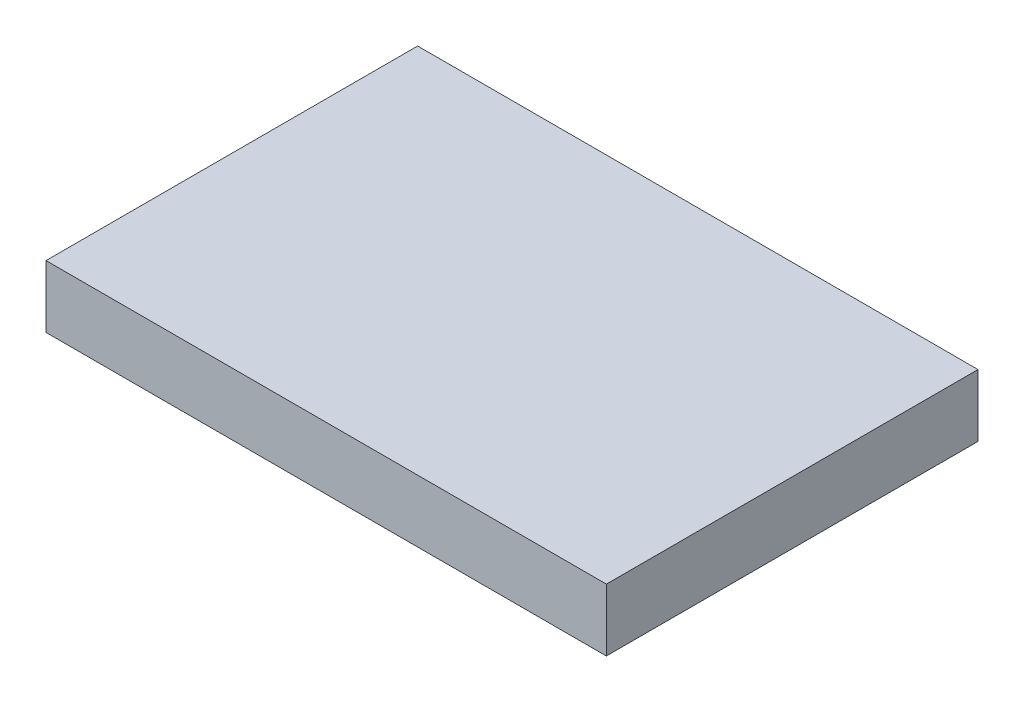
ISO-10303-21;
HEADER;
FILE_DESCRIPTION(('STEP AP214'),'2;1');
FILE_NAME('part.step','',(''),(''),'','','');
FILE_SCHEMA(('AUTOMOTIVE_DESIGN { 1 0 10303 214 1 1 1 1 }'));
ENDSEC;
DATA;
#1=APPLICATION_CONTEXT('core data for automotive mechanical design processes');
#2=APPLICATION_PROTOCOL_DEFINITION('international standard','automotive_design',2000,#1);
#3=PRODUCT_CONTEXT('',#1,'mechanical');
#4=PRODUCT('Part','Part','',(#3));
#5=PRODUCT_RELATED_PRODUCT_CATEGORY('part','',(#4));
#6=PRODUCT_DEFINITION_FORMATION('','',#4);
#7=PRODUCT_DEFINITION_CONTEXT('part definition',#1,'design');
#8=PRODUCT_DEFINITION('design','',#6,#7);
#9=PRODUCT_DEFINITION_SHAPE('','',#8);
#10=(LENGTH_UNIT() NAMED_UNIT(*) SI_UNIT(.MILLI.,.METRE.));
#11=(NAMED_UNIT(*) PLANE_ANGLE_UNIT() SI_UNIT($,.RADIAN.));
#12=(NAMED_UNIT(*) SI_UNIT($,.STERADIAN.) SOLID_ANGLE_UNIT());
#13=UNCERTAINTY_MEASURE_WITH_UNIT(LENGTH_MEASURE(1.E-05),#10,'distance_accuracy_value','');
#14=(GEOMETRIC_REPRESENTATION_CONTEXT(3) GLOBAL_UNCERTAINTY_ASSIGNED_CONTEXT((#13)) GLOBAL_UNIT_ASSIGNED_CONTEXT((#10,
#11,#12)) REPRESENTATION_CONTEXT('',''));
#15=CARTESIAN_POINT('',(0.,0.,0.));
#16=DIRECTION('',(0.,0.,1.));
#17=DIRECTION('',(1.,0.,0.));
#18=AXIS2_PLACEMENT_3D('',#15,#16,#17);
#19=CARTESIAN_POINT('',(0.,812.8,0.));
#20=DIRECTION('',(1.,0.,0.));
#21=DIRECTION('',(0.,0.,-1.));
#22=AXIS2_PLACEMENT_3D('',#19,#20,#21);
#23=PLANE('',#22);
#24=DIRECTION('',(0.,0.,1.));
#25=VECTOR('',#24,1.);
#26=CARTESIAN_POINT('',(0.,0.,0.));
#27=LINE('',#26,#25);
#28=CARTESIAN_POINT('',(0.,0.,-4851.4));
#29=VERTEX_POINT('',#28);
#30=CARTESIAN_POINT('',(0.,0.,0.));
#31=VERTEX_POINT('',#30);
#32=EDGE_CURVE('E107',#29,#31,#27,.T.);
#33=ORIENTED_EDGE('',*,*,#32,.T.);
#34=DIRECTION('',(0.,-1.,0.));
#35=VECTOR('',#34,1.);
#36=CARTESIAN_POINT('',(0.,812.8,0.));
#37=LINE('',#36,#35);
#38=CARTESIAN_POINT('',(0.,812.8,0.));
#39=VERTEX_POINT('',#38);
#40=EDGE_CURVE('E11',#39,#31,#37,.T.);
#41=ORIENTED_EDGE('',*,*,#40,.F.);
#42=DIRECTION('',(0.,0.,1.));
#43=VECTOR('',#42,1.);
#44=CARTESIAN_POINT('',(0.,812.8,0.));
#45=LINE('',#44,#43);
#46=CARTESIAN_POINT('',(0.,812.8,-4851.4));
#47=VERTEX_POINT('',#46);
#48=EDGE_CURVE('E91',#47,#39,#45,.T.);
#49=ORIENTED_EDGE('',*,*,#48,.F.);
#50=DIRECTION('',(0.,-1.,0.));
#51=VECTOR('',#50,1.);
#52=CARTESIAN_POINT('',(0.,812.8,-4851.4));
#53=LINE('',#52,#51);
#54=EDGE_CURVE('E103',#47,#29,#53,.T.);
#55=ORIENTED_EDGE('',*,*,#54,.T.);
#56=EDGE_LOOP('',(#33,#41,#49,#55));
#57=FACE_BOUND('',#56,.T.);
#58=ADVANCED_FACE('F39',(#57),#23,.F.);
#59=CARTESIAN_POINT('',(0.,812.8,0.));
#60=DIRECTION('',(0.,0.,-1.));
#61=DIRECTION('',(-1.,0.,0.));
#62=AXIS2_PLACEMENT_3D('',#59,#60,#61);
#63=PLANE('',#62);
#64=DIRECTION('',(1.,0.,0.));
#65=VECTOR('',#64,1.);
#66=CARTESIAN_POINT('',(0.,0.,0.));
#67=LINE('',#66,#65);
#68=CARTESIAN_POINT('',(7315.2,0.,0.));
#69=VERTEX_POINT('',#68);
#70=EDGE_CURVE('E96',#31,#69,#67,.T.);
#71=ORIENTED_EDGE('',*,*,#70,.T.);
#72=DIRECTION('',(0.,-1.,0.));
#73=VECTOR('',#72,1.);
#74=CARTESIAN_POINT('',(7315.2,812.8,0.));
#75=LINE('',#74,#73);
#76=CARTESIAN_POINT('',(7315.2,812.8,0.));
#77=VERTEX_POINT('',#76);
#78=EDGE_CURVE('E48',#77,#69,#75,.T.);
#79=ORIENTED_EDGE('',*,*,#78,.F.);
#80=DIRECTION('',(1.,0.,0.));
#81=VECTOR('',#80,1.);
#82=CARTESIAN_POINT('',(0.,812.8,0.));
#83=LINE('',#82,#81);
#84=EDGE_CURVE('E86',#39,#77,#83,.T.);
#85=ORIENTED_EDGE('',*,*,#84,.F.);
#86=ORIENTED_EDGE('',*,*,#40,.T.);
#87=EDGE_LOOP('',(#71,#79,#85,#86));
#88=FACE_BOUND('',#87,.T.);
#89=ADVANCED_FACE('F95',(#88),#63,.F.);
#90=CARTESIAN_POINT('',(7315.2,812.8,0.));
#91=DIRECTION('',(-1.,0.,0.));
#92=DIRECTION('',(0.,0.,1.));
#93=AXIS2_PLACEMENT_3D('',#90,#91,#92);
#94=PLANE('',#93);
#95=DIRECTION('',(0.,0.,-1.));
#96=VECTOR('',#95,1.);
#97=CARTESIAN_POINT('',(7315.2,0.,0.));
#98=LINE('',#97,#96);
#99=CARTESIAN_POINT('',(7315.2,0.,-4851.4));
#100=VERTEX_POINT('',#99);
#101=EDGE_CURVE('E73',#69,#100,#98,.T.);
#102=ORIENTED_EDGE('',*,*,#101,.T.);
#103=DIRECTION('',(0.,-1.,0.));
#104=VECTOR('',#103,1.);
#105=CARTESIAN_POINT('',(7315.2,812.8,-4851.4));
#106=LINE('',#105,#104);
#107=CARTESIAN_POINT('',(7315.2,812.8,-4851.4));
#108=VERTEX_POINT('',#107);
#109=EDGE_CURVE('E98',#108,#100,#106,.T.);
#110=ORIENTED_EDGE('',*,*,#109,.F.);
#111=DIRECTION('',(0.,0.,-1.));
#112=VECTOR('',#111,1.);
#113=CARTESIAN_POINT('',(7315.2,812.8,0.));
#114=LINE('',#113,#112);
#115=EDGE_CURVE('E89',#77,#108,#114,.T.);
#116=ORIENTED_EDGE('',*,*,#115,.F.);
#117=ORIENTED_EDGE('',*,*,#78,.T.);
#118=EDGE_LOOP('',(#102,#110,#116,#117));
#119=FACE_BOUND('',#118,.T.);
#120=ADVANCED_FACE('F99',(#119),#94,.F.);
#121=CARTESIAN_POINT('',(0.,812.8,-4851.4));
#122=DIRECTION('',(0.,0.,1.));
#123=DIRECTION('',(1.,0.,0.));
#124=AXIS2_PLACEMENT_3D('',#121,#122,#123);
#125=PLANE('',#124);
#126=DIRECTION('',(-1.,0.,0.));
#127=VECTOR('',#126,1.);
#128=CARTESIAN_POINT('',(0.,0.,-4851.4));
#129=LINE('',#128,#127);
#130=EDGE_CURVE('E79',#100,#29,#129,.T.);
#131=ORIENTED_EDGE('',*,*,#130,.T.);
#132=ORIENTED_EDGE('',*,*,#54,.F.);
#133=DIRECTION('',(-1.,0.,0.));
#134=VECTOR('',#133,1.);
#135=CARTESIAN_POINT('',(0.,812.8,-4851.4));
#136=LINE('',#135,#134);
#137=EDGE_CURVE('E56',#108,#47,#136,.T.);
#138=ORIENTED_EDGE('',*,*,#137,.F.);
#139=ORIENTED_EDGE('',*,*,#109,.T.);
#140=EDGE_LOOP('',(#131,#132,#138,#139));
#141=FACE_BOUND('',#140,.T.);
#142=ADVANCED_FACE('F120',(#141),#125,.F.);
#143=CARTESIAN_POINT('',(0.,812.8,0.));
#144=DIRECTION('',(0.,-1.,0.));
#145=DIRECTION('',(0.,0.,-1.));
#146=AXIS2_PLACEMENT_3D('',#143,#144,#145);
#147=PLANE('',#146);
#148=ORIENTED_EDGE('',*,*,#48,.T.);
#149=ORIENTED_EDGE('',*,*,#84,.T.);
#150=ORIENTED_EDGE('',*,*,#115,.T.);
#151=ORIENTED_EDGE('',*,*,#137,.T.);
#152=EDGE_LOOP('',(#148,#149,#150,#151));
#153=FACE_BOUND('',#152,.T.);
#154=ADVANCED_FACE('F87',(#153),#147,.F.);
#155=CARTESIAN_POINT('',(0.,0.,0.));
#156=DIRECTION('',(0.,-1.,0.));
#157=DIRECTION('',(0.,0.,-1.));
#158=AXIS2_PLACEMENT_3D('',#155,#156,#157);
#159=PLANE('',#158);
#160=ORIENTED_EDGE('',*,*,#32,.F.);
#161=ORIENTED_EDGE('',*,*,#130,.F.);
#162=ORIENTED_EDGE('',*,*,#101,.F.);
#163=ORIENTED_EDGE('',*,*,#70,.F.);
#164=EDGE_LOOP('',(#160,#161,#162,#163));
#165=FACE_BOUND('',#164,.T.);
#166=ADVANCED_FACE('F123',(#165),#159,.T.);
#167=CLOSED_SHELL('',(#58,#89,#120,#142,#154,#166));
#168=MANIFOLD_SOLID_BREP('B2',#167);
#169=ADVANCED_BREP_SHAPE_REPRESENTATION('',(#18,#168),#14);
#170=SHAPE_DEFINITION_REPRESENTATION(#9,#169);
ENDSEC;
END-ISO-10303-21;
